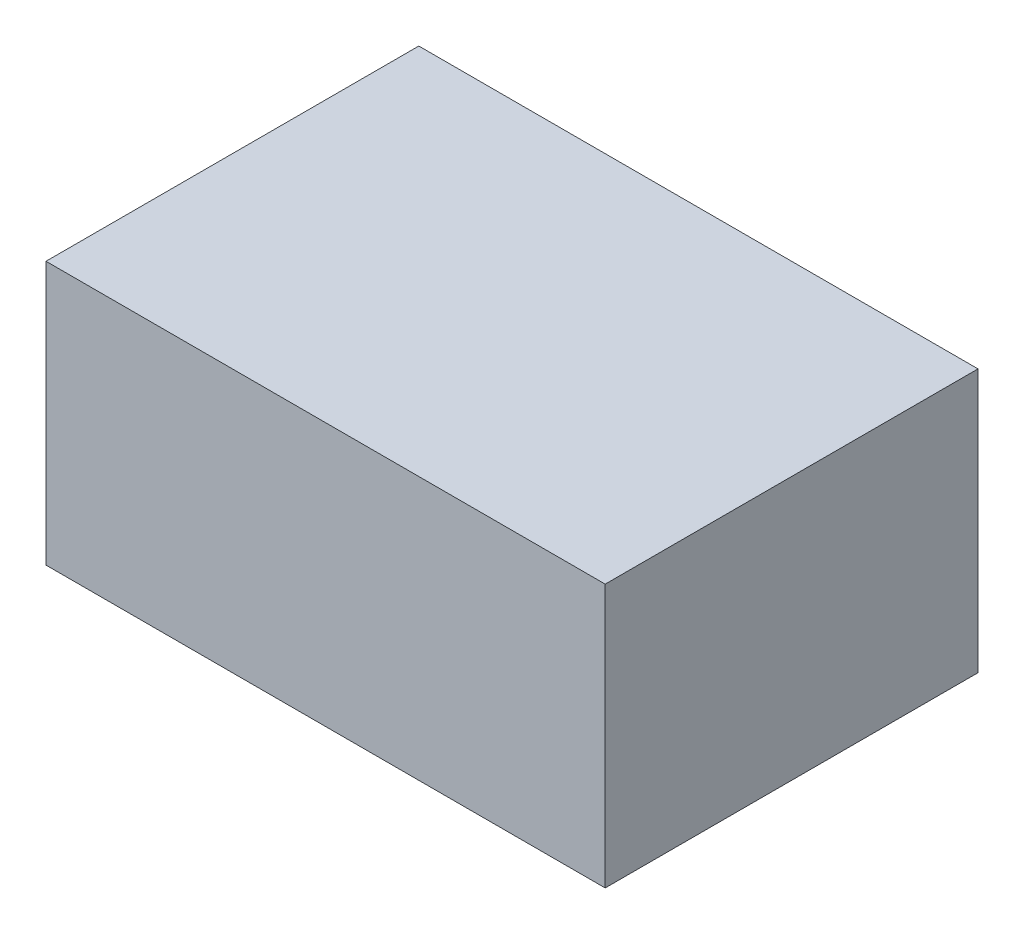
from build123d import *

# Parameters (mm, degrees)
ESQUISSE1_W      = 255
ESQUISSE1_H      = 120
EXTRUSION1_DEPTH = 170


with BuildPart() as part:
    # Esquisse1 → Extrusion1 (new body)
    with BuildSketch(Plane.XY):
        with Locations((77.488459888, 70.594047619)):
            Rectangle(ESQUISSE1_W, ESQUISSE1_H)
    extrude(amount=EXTRUSION1_DEPTH)


solid = part.part
